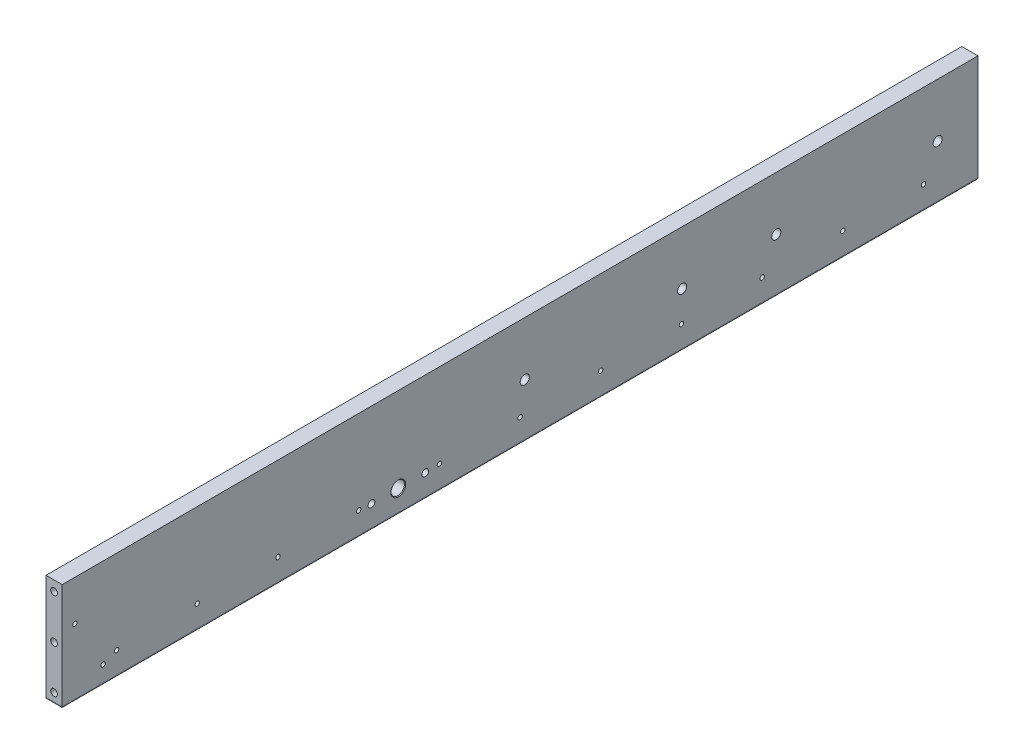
ISO-10303-21;
HEADER;
FILE_DESCRIPTION(('STEP AP214'),'2;1');
FILE_NAME('part.step','',(''),(''),'','','');
FILE_SCHEMA(('AUTOMOTIVE_DESIGN { 1 0 10303 214 1 1 1 1 }'));
ENDSEC;
DATA;
#1=APPLICATION_CONTEXT('core data for automotive mechanical design processes');
#2=APPLICATION_PROTOCOL_DEFINITION('international standard','automotive_design',2000,#1);
#3=PRODUCT_CONTEXT('',#1,'mechanical');
#4=PRODUCT('Part','Part','',(#3));
#5=PRODUCT_RELATED_PRODUCT_CATEGORY('part','',(#4));
#6=PRODUCT_DEFINITION_FORMATION('','',#4);
#7=PRODUCT_DEFINITION_CONTEXT('part definition',#1,'design');
#8=PRODUCT_DEFINITION('design','',#6,#7);
#9=PRODUCT_DEFINITION_SHAPE('','',#8);
#10=(LENGTH_UNIT() NAMED_UNIT(*) SI_UNIT(.MILLI.,.METRE.));
#11=(NAMED_UNIT(*) PLANE_ANGLE_UNIT() SI_UNIT($,.RADIAN.));
#12=(NAMED_UNIT(*) SI_UNIT($,.STERADIAN.) SOLID_ANGLE_UNIT());
#13=UNCERTAINTY_MEASURE_WITH_UNIT(LENGTH_MEASURE(1.E-05),#10,'distance_accuracy_value','');
#14=(GEOMETRIC_REPRESENTATION_CONTEXT(3) GLOBAL_UNCERTAINTY_ASSIGNED_CONTEXT((#13)) GLOBAL_UNIT_ASSIGNED_CONTEXT((#10,
#11,#12)) REPRESENTATION_CONTEXT('',''));
#15=CARTESIAN_POINT('',(0.,0.,0.));
#16=DIRECTION('',(0.,0.,1.));
#17=DIRECTION('',(1.,0.,0.));
#18=AXIS2_PLACEMENT_3D('',#15,#16,#17);
#19=CARTESIAN_POINT('',(-4.50000000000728,-22.5,300.));
#20=DIRECTION('',(1.,0.,0.));
#21=DIRECTION('',(0.,0.,-1.));
#22=AXIS2_PLACEMENT_3D('',#19,#20,#21);
#23=CONICAL_SURFACE('',#22,1.6499999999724,1.04719755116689);
#24=CARTESIAN_POINT('',(-5.45262794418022,-22.5,300.));
#25=VERTEX_POINT('',#24);
#26=VERTEX_LOOP('',#25);
#27=FACE_BOUND('',#26,.T.);
#28=CARTESIAN_POINT('',(-4.49999999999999,-22.5,300.));
#29=DIRECTION('',(1.,0.,0.));
#30=DIRECTION('',(0.,0.,-1.));
#31=AXIS2_PLACEMENT_3D('',#28,#29,#30);
#32=CIRCLE('',#31,1.64999999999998);
#33=CARTESIAN_POINT('',(-4.49999999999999,-22.5,298.35));
#34=VERTEX_POINT('',#33);
#35=EDGE_CURVE('E121',#34,#34,#32,.T.);
#36=ORIENTED_EDGE('',*,*,#35,.T.);
#37=EDGE_LOOP('',(#36));
#38=FACE_BOUND('',#37,.T.);
#39=ADVANCED_FACE('F16',(#27,#38),#23,.F.);
#40=CARTESIAN_POINT('',(-4.50000000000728,-22.5,240.));
#41=DIRECTION('',(1.,0.,0.));
#42=DIRECTION('',(0.,0.,-1.));
#43=AXIS2_PLACEMENT_3D('',#40,#41,#42);
#44=CONICAL_SURFACE('',#43,1.6499999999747,1.04719755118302);
#45=CARTESIAN_POINT('',(-5.45262794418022,-22.5,240.));
#46=VERTEX_POINT('',#45);
#47=VERTEX_LOOP('',#46);
#48=FACE_BOUND('',#47,.T.);
#49=CARTESIAN_POINT('',(-4.49999999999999,-22.5,240.));
#50=DIRECTION('',(1.,0.,0.));
#51=DIRECTION('',(0.,0.,-1.));
#52=AXIS2_PLACEMENT_3D('',#49,#50,#51);
#53=CIRCLE('',#52,1.64999999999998);
#54=CARTESIAN_POINT('',(-4.49999999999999,-22.5,238.35));
#55=VERTEX_POINT('',#54);
#56=EDGE_CURVE('E123',#55,#55,#53,.T.);
#57=ORIENTED_EDGE('',*,*,#56,.T.);
#58=EDGE_LOOP('',(#57));
#59=FACE_BOUND('',#58,.T.);
#60=ADVANCED_FACE('F118',(#48,#59),#44,.F.);
#61=CARTESIAN_POINT('',(-4.50000000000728,-22.5,180.));
#62=DIRECTION('',(1.,0.,0.));
#63=DIRECTION('',(0.,0.,-1.));
#64=AXIS2_PLACEMENT_3D('',#61,#62,#63);
#65=CONICAL_SURFACE('',#64,1.64999999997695,1.04719755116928);
#66=CARTESIAN_POINT('',(-5.45262794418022,-22.5,180.));
#67=VERTEX_POINT('',#66);
#68=VERTEX_LOOP('',#67);
#69=FACE_BOUND('',#68,.T.);
#70=CARTESIAN_POINT('',(-4.49999999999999,-22.5,180.));
#71=DIRECTION('',(1.,0.,0.));
#72=DIRECTION('',(0.,0.,-1.));
#73=AXIS2_PLACEMENT_3D('',#70,#71,#72);
#74=CIRCLE('',#73,1.64999999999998);
#75=CARTESIAN_POINT('',(-4.49999999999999,-22.5,178.35));
#76=VERTEX_POINT('',#75);
#77=EDGE_CURVE('E126',#76,#76,#74,.T.);
#78=ORIENTED_EDGE('',*,*,#77,.T.);
#79=EDGE_LOOP('',(#78));
#80=FACE_BOUND('',#79,.T.);
#81=ADVANCED_FACE('F306',(#69,#80),#65,.F.);
#82=CARTESIAN_POINT('',(-4.49999999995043,-22.5,120.));
#83=DIRECTION('',(1.,0.,0.));
#84=DIRECTION('',(0.,0.,-1.));
#85=AXIS2_PLACEMENT_3D('',#82,#83,#84);
#86=CONICAL_SURFACE('',#85,1.64999999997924,1.04719755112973);
#87=CARTESIAN_POINT('',(-5.45262794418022,-22.5,120.));
#88=VERTEX_POINT('',#87);
#89=VERTEX_LOOP('',#88);
#90=FACE_BOUND('',#89,.T.);
#91=CARTESIAN_POINT('',(-4.49999999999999,-22.5,120.));
#92=DIRECTION('',(1.,0.,0.));
#93=DIRECTION('',(0.,0.,-1.));
#94=AXIS2_PLACEMENT_3D('',#91,#92,#93);
#95=CIRCLE('',#94,1.65);
#96=CARTESIAN_POINT('',(-4.49999999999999,-22.5,118.35));
#97=VERTEX_POINT('',#96);
#98=EDGE_CURVE('E301',#97,#97,#95,.T.);
#99=ORIENTED_EDGE('',*,*,#98,.T.);
#100=EDGE_LOOP('',(#99));
#101=FACE_BOUND('',#100,.T.);
#102=ADVANCED_FACE('F525',(#90,#101),#86,.F.);
#103=CARTESIAN_POINT('',(-4.49999999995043,-22.5,60.0000000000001));
#104=DIRECTION('',(1.,0.,0.));
#105=DIRECTION('',(0.,0.,-1.));
#106=AXIS2_PLACEMENT_3D('',#103,#104,#105);
#107=CONICAL_SURFACE('',#106,1.65000000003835,1.04719755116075);
#108=CARTESIAN_POINT('',(-5.45262794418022,-22.5,60.0000000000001));
#109=VERTEX_POINT('',#108);
#110=VERTEX_LOOP('',#109);
#111=FACE_BOUND('',#110,.T.);
#112=CARTESIAN_POINT('',(-4.49999999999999,-22.5,60.0000000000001));
#113=DIRECTION('',(1.,0.,0.));
#114=DIRECTION('',(0.,0.,-1.));
#115=AXIS2_PLACEMENT_3D('',#112,#113,#114);
#116=CIRCLE('',#115,1.65);
#117=CARTESIAN_POINT('',(-4.49999999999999,-22.5,58.3500000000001));
#118=VERTEX_POINT('',#117);
#119=EDGE_CURVE('E298',#118,#118,#116,.T.);
#120=ORIENTED_EDGE('',*,*,#119,.T.);
#121=EDGE_LOOP('',(#120));
#122=FACE_BOUND('',#121,.T.);
#123=ADVANCED_FACE('F521',(#111,#122),#107,.F.);
#124=CARTESIAN_POINT('',(-4.50000000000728,-22.5,0.));
#125=DIRECTION('',(1.,0.,0.));
#126=DIRECTION('',(0.,0.,-1.));
#127=AXIS2_PLACEMENT_3D('',#124,#125,#126);
#128=CONICAL_SURFACE('',#127,1.64999999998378,1.04719755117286);
#129=CARTESIAN_POINT('',(-5.45262794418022,-22.5,0.));
#130=VERTEX_POINT('',#129);
#131=VERTEX_LOOP('',#130);
#132=FACE_BOUND('',#131,.T.);
#133=CARTESIAN_POINT('',(-4.49999999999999,-22.5,0.));
#134=DIRECTION('',(1.,0.,0.));
#135=DIRECTION('',(0.,0.,-1.));
#136=AXIS2_PLACEMENT_3D('',#133,#134,#135);
#137=CIRCLE('',#136,1.65);
#138=CARTESIAN_POINT('',(-4.49999999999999,-22.5,-1.64999999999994));
#139=VERTEX_POINT('',#138);
#140=EDGE_CURVE('E295',#139,#139,#137,.T.);
#141=ORIENTED_EDGE('',*,*,#140,.T.);
#142=EDGE_LOOP('',(#141));
#143=FACE_BOUND('',#142,.T.);
#144=ADVANCED_FACE('F517',(#132,#143),#128,.F.);
#145=CARTESIAN_POINT('',(-4.49999999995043,-22.5,-59.9999999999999));
#146=DIRECTION('',(1.,0.,0.));
#147=DIRECTION('',(0.,0.,-1.));
#148=AXIS2_PLACEMENT_3D('',#145,#146,#147);
#149=CONICAL_SURFACE('',#148,1.65000000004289,1.04719755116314);
#150=CARTESIAN_POINT('',(-5.45262794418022,-22.5,-59.9999999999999));
#151=VERTEX_POINT('',#150);
#152=VERTEX_LOOP('',#151);
#153=FACE_BOUND('',#152,.T.);
#154=CARTESIAN_POINT('',(-4.49999999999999,-22.5,-59.9999999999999));
#155=DIRECTION('',(1.,0.,0.));
#156=DIRECTION('',(0.,0.,-1.));
#157=AXIS2_PLACEMENT_3D('',#154,#155,#156);
#158=CIRCLE('',#157,1.65);
#159=CARTESIAN_POINT('',(-4.49999999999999,-22.5,-61.6499999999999));
#160=VERTEX_POINT('',#159);
#161=EDGE_CURVE('E292',#160,#160,#158,.T.);
#162=ORIENTED_EDGE('',*,*,#161,.T.);
#163=EDGE_LOOP('',(#162));
#164=FACE_BOUND('',#163,.T.);
#165=ADVANCED_FACE('F513',(#153,#164),#149,.F.);
#166=CARTESIAN_POINT('',(-4.50000000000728,-22.5,-120.));
#167=DIRECTION('',(1.,0.,0.));
#168=DIRECTION('',(0.,0.,-1.));
#169=AXIS2_PLACEMENT_3D('',#166,#167,#168);
#170=CONICAL_SURFACE('',#169,1.64999999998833,1.04719755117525);
#171=CARTESIAN_POINT('',(-5.45262794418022,-22.5,-120.));
#172=VERTEX_POINT('',#171);
#173=VERTEX_LOOP('',#172);
#174=FACE_BOUND('',#173,.T.);
#175=CARTESIAN_POINT('',(-4.49999999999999,-22.5,-120.));
#176=DIRECTION('',(1.,0.,0.));
#177=DIRECTION('',(0.,0.,-1.));
#178=AXIS2_PLACEMENT_3D('',#175,#176,#177);
#179=CIRCLE('',#178,1.65);
#180=CARTESIAN_POINT('',(-4.49999999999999,-22.5,-121.65));
#181=VERTEX_POINT('',#180);
#182=EDGE_CURVE('E289',#181,#181,#179,.T.);
#183=ORIENTED_EDGE('',*,*,#182,.T.);
#184=EDGE_LOOP('',(#183));
#185=FACE_BOUND('',#184,.T.);
#186=ADVANCED_FACE('F509',(#174,#185),#170,.F.);
#187=CARTESIAN_POINT('',(-4.50000000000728,-22.5,-180.));
#188=DIRECTION('',(1.,0.,0.));
#189=DIRECTION('',(0.,0.,-1.));
#190=AXIS2_PLACEMENT_3D('',#187,#188,#189);
#191=CONICAL_SURFACE('',#190,1.6499999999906,1.04719755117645);
#192=CARTESIAN_POINT('',(-5.45262794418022,-22.5,-180.));
#193=VERTEX_POINT('',#192);
#194=VERTEX_LOOP('',#193);
#195=FACE_BOUND('',#194,.T.);
#196=CARTESIAN_POINT('',(-4.49999999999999,-22.5,-180.));
#197=DIRECTION('',(1.,0.,0.));
#198=DIRECTION('',(0.,0.,-1.));
#199=AXIS2_PLACEMENT_3D('',#196,#197,#198);
#200=CIRCLE('',#199,1.64999999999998);
#201=CARTESIAN_POINT('',(-4.49999999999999,-22.5,-181.65));
#202=VERTEX_POINT('',#201);
#203=EDGE_CURVE('E286',#202,#202,#200,.T.);
#204=ORIENTED_EDGE('',*,*,#203,.T.);
#205=EDGE_LOOP('',(#204));
#206=FACE_BOUND('',#205,.T.);
#207=ADVANCED_FACE('F505',(#195,#206),#191,.F.);
#208=CARTESIAN_POINT('',(-4.50000000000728,-22.5,-240.));
#209=DIRECTION('',(1.,0.,0.));
#210=DIRECTION('',(0.,0.,-1.));
#211=AXIS2_PLACEMENT_3D('',#208,#209,#210);
#212=CONICAL_SURFACE('',#211,1.64999999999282,1.04719755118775);
#213=CARTESIAN_POINT('',(-5.45262794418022,-22.5,-240.));
#214=VERTEX_POINT('',#213);
#215=VERTEX_LOOP('',#214);
#216=FACE_BOUND('',#215,.T.);
#217=CARTESIAN_POINT('',(-4.49999999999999,-22.5,-240.));
#218=DIRECTION('',(1.,0.,0.));
#219=DIRECTION('',(0.,0.,-1.));
#220=AXIS2_PLACEMENT_3D('',#217,#218,#219);
#221=CIRCLE('',#220,1.64999999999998);
#222=CARTESIAN_POINT('',(-4.49999999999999,-22.5,-241.65));
#223=VERTEX_POINT('',#222);
#224=EDGE_CURVE('E283',#223,#223,#221,.T.);
#225=ORIENTED_EDGE('',*,*,#224,.T.);
#226=EDGE_LOOP('',(#225));
#227=FACE_BOUND('',#226,.T.);
#228=ADVANCED_FACE('F501',(#216,#227),#212,.F.);
#229=CARTESIAN_POINT('',(-4.50000000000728,-22.5,-300.));
#230=DIRECTION('',(1.,0.,0.));
#231=DIRECTION('',(0.,0.,-1.));
#232=AXIS2_PLACEMENT_3D('',#229,#230,#231);
#233=CONICAL_SURFACE('',#232,1.650000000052,1.04719755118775);
#234=CARTESIAN_POINT('',(-5.45262794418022,-22.5,-300.));
#235=VERTEX_POINT('',#234);
#236=VERTEX_LOOP('',#235);
#237=FACE_BOUND('',#236,.T.);
#238=CARTESIAN_POINT('',(-4.49999999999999,-22.5,-300.));
#239=DIRECTION('',(1.,0.,0.));
#240=DIRECTION('',(0.,0.,-1.));
#241=AXIS2_PLACEMENT_3D('',#238,#239,#240);
#242=CIRCLE('',#241,1.64999999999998);
#243=CARTESIAN_POINT('',(-4.49999999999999,-22.5,-301.65));
#244=VERTEX_POINT('',#243);
#245=EDGE_CURVE('E280',#244,#244,#242,.T.);
#246=ORIENTED_EDGE('',*,*,#245,.T.);
#247=EDGE_LOOP('',(#246));
#248=FACE_BOUND('',#247,.T.);
#249=ADVANCED_FACE('F497',(#237,#248),#233,.F.);
#250=CARTESIAN_POINT('',(0.,-32.5,323.500000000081));
#251=DIRECTION('',(0.,0.,1.));
#252=DIRECTION('',(1.,0.,0.));
#253=AXIS2_PLACEMENT_3D('',#250,#251,#252);
#254=CONICAL_SURFACE('',#253,2.49999999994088,1.02974425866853);
#255=CARTESIAN_POINT('',(-5.6843418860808E-11,-32.5,321.997848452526));
#256=VERTEX_POINT('',#255);
#257=VERTEX_LOOP('',#256);
#258=FACE_BOUND('',#257,.T.);
#259=CARTESIAN_POINT('',(0.,-32.5,323.5));
#260=DIRECTION('',(0.,0.,1.));
#261=DIRECTION('',(1.,0.,0.));
#262=AXIS2_PLACEMENT_3D('',#259,#260,#261);
#263=CIRCLE('',#262,2.49999999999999);
#264=CARTESIAN_POINT('',(2.49999999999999,-32.5,323.5));
#265=VERTEX_POINT('',#264);
#266=EDGE_CURVE('E274',#265,#265,#263,.T.);
#267=ORIENTED_EDGE('',*,*,#266,.T.);
#268=EDGE_LOOP('',(#267));
#269=FACE_BOUND('',#268,.T.);
#270=ADVANCED_FACE('F493',(#258,#269),#254,.F.);
#271=CARTESIAN_POINT('',(0.,0.,323.500000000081));
#272=DIRECTION('',(0.,0.,1.));
#273=DIRECTION('',(1.,0.,0.));
#274=AXIS2_PLACEMENT_3D('',#271,#272,#273);
#275=CONICAL_SURFACE('',#274,2.49999999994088,1.02974425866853);
#276=CARTESIAN_POINT('',(-5.6843418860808E-11,0.,321.997848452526));
#277=VERTEX_POINT('',#276);
#278=VERTEX_LOOP('',#277);
#279=FACE_BOUND('',#278,.T.);
#280=CARTESIAN_POINT('',(0.,0.,323.5));
#281=DIRECTION('',(0.,0.,1.));
#282=DIRECTION('',(1.,0.,0.));
#283=AXIS2_PLACEMENT_3D('',#280,#281,#282);
#284=CIRCLE('',#283,2.49999999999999);
#285=CARTESIAN_POINT('',(2.49999999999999,0.,323.5));
#286=VERTEX_POINT('',#285);
#287=EDGE_CURVE('E271',#286,#286,#284,.T.);
#288=ORIENTED_EDGE('',*,*,#287,.T.);
#289=EDGE_LOOP('',(#288));
#290=FACE_BOUND('',#289,.T.);
#291=ADVANCED_FACE('F489',(#279,#290),#275,.F.);
#292=CARTESIAN_POINT('',(0.,32.5,323.500000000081));
#293=DIRECTION('',(0.,0.,1.));
#294=DIRECTION('',(1.,0.,0.));
#295=AXIS2_PLACEMENT_3D('',#292,#293,#294);
#296=CONICAL_SURFACE('',#295,2.49999999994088,1.02974425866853);
#297=CARTESIAN_POINT('',(-5.6843418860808E-11,32.5,321.997848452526));
#298=VERTEX_POINT('',#297);
#299=VERTEX_LOOP('',#298);
#300=FACE_BOUND('',#299,.T.);
#301=CARTESIAN_POINT('',(0.,32.5,323.5));
#302=DIRECTION('',(0.,0.,1.));
#303=DIRECTION('',(1.,0.,0.));
#304=AXIS2_PLACEMENT_3D('',#301,#302,#303);
#305=CIRCLE('',#304,2.49999999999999);
#306=CARTESIAN_POINT('',(2.49999999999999,32.5,323.5));
#307=VERTEX_POINT('',#306);
#308=EDGE_CURVE('E268',#307,#307,#305,.T.);
#309=ORIENTED_EDGE('',*,*,#308,.T.);
#310=EDGE_LOOP('',(#309));
#311=FACE_BOUND('',#310,.T.);
#312=ADVANCED_FACE('F485',(#300,#311),#296,.F.);
#313=CARTESIAN_POINT('',(0.,-32.5,-323.500000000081));
#314=DIRECTION('',(0.,0.,-1.));
#315=DIRECTION('',(-1.,0.,0.));
#316=AXIS2_PLACEMENT_3D('',#313,#314,#315);
#317=CONICAL_SURFACE('',#316,2.49999999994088,1.02974425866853);
#318=CARTESIAN_POINT('',(-5.6843418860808E-11,-32.5,-321.997848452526));
#319=VERTEX_POINT('',#318);
#320=VERTEX_LOOP('',#319);
#321=FACE_BOUND('',#320,.T.);
#322=CARTESIAN_POINT('',(0.,-32.5,-323.5));
#323=DIRECTION('',(0.,0.,-1.));
#324=DIRECTION('',(-1.,0.,0.));
#325=AXIS2_PLACEMENT_3D('',#322,#323,#324);
#326=CIRCLE('',#325,2.49999999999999);
#327=CARTESIAN_POINT('',(-2.49999999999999,-32.5,-323.5));
#328=VERTEX_POINT('',#327);
#329=EDGE_CURVE('E260',#328,#328,#326,.T.);
#330=ORIENTED_EDGE('',*,*,#329,.T.);
#331=EDGE_LOOP('',(#330));
#332=FACE_BOUND('',#331,.T.);
#333=ADVANCED_FACE('F481',(#321,#332),#317,.F.);
#334=CARTESIAN_POINT('',(0.,0.,-323.500000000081));
#335=DIRECTION('',(0.,0.,-1.));
#336=DIRECTION('',(-1.,0.,0.));
#337=AXIS2_PLACEMENT_3D('',#334,#335,#336);
#338=CONICAL_SURFACE('',#337,2.49999999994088,1.02974425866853);
#339=CARTESIAN_POINT('',(-5.6843418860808E-11,0.,-321.997848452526));
#340=VERTEX_POINT('',#339);
#341=VERTEX_LOOP('',#340);
#342=FACE_BOUND('',#341,.T.);
#343=CARTESIAN_POINT('',(0.,0.,-323.5));
#344=DIRECTION('',(0.,0.,-1.));
#345=DIRECTION('',(-1.,0.,0.));
#346=AXIS2_PLACEMENT_3D('',#343,#344,#345);
#347=CIRCLE('',#346,2.49999999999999);
#348=CARTESIAN_POINT('',(-2.49999999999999,0.,-323.5));
#349=VERTEX_POINT('',#348);
#350=EDGE_CURVE('E255',#349,#349,#347,.T.);
#351=ORIENTED_EDGE('',*,*,#350,.T.);
#352=EDGE_LOOP('',(#351));
#353=FACE_BOUND('',#352,.T.);
#354=ADVANCED_FACE('F478',(#342,#353),#338,.F.);
#355=CARTESIAN_POINT('',(0.,32.5,-323.500000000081));
#356=DIRECTION('',(0.,0.,-1.));
#357=DIRECTION('',(-1.,0.,0.));
#358=AXIS2_PLACEMENT_3D('',#355,#356,#357);
#359=CONICAL_SURFACE('',#358,2.49999999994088,1.02974425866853);
#360=CARTESIAN_POINT('',(-5.6843418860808E-11,32.5,-321.997848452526));
#361=VERTEX_POINT('',#360);
#362=VERTEX_LOOP('',#361);
#363=FACE_BOUND('',#362,.T.);
#364=CARTESIAN_POINT('',(0.,32.5,-323.5));
#365=DIRECTION('',(0.,0.,-1.));
#366=DIRECTION('',(-1.,0.,0.));
#367=AXIS2_PLACEMENT_3D('',#364,#365,#366);
#368=CIRCLE('',#367,2.49999999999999);
#369=CARTESIAN_POINT('',(-2.49999999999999,32.5,-323.5));
#370=VERTEX_POINT('',#369);
#371=EDGE_CURVE('E250',#370,#370,#368,.T.);
#372=ORIENTED_EDGE('',*,*,#371,.T.);
#373=EDGE_LOOP('',(#372));
#374=FACE_BOUND('',#373,.T.);
#375=ADVANCED_FACE('F475',(#363,#374),#359,.F.);
#376=CARTESIAN_POINT('',(6.00000000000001,-22.5,300.));
#377=DIRECTION('',(1.,0.,0.));
#378=DIRECTION('',(0.,0.,-1.));
#379=AXIS2_PLACEMENT_3D('',#376,#377,#378);
#380=CYLINDRICAL_SURFACE('',#379,1.64999999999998);
#381=ORIENTED_EDGE('',*,*,#35,.F.);
#382=EDGE_LOOP('',(#381));
#383=FACE_BOUND('',#382,.T.);
#384=CARTESIAN_POINT('',(6.00000000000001,-22.5,300.));
#385=DIRECTION('',(1.,0.,0.));
#386=DIRECTION('',(0.,0.,-1.));
#387=AXIS2_PLACEMENT_3D('',#384,#385,#386);
#388=CIRCLE('',#387,1.64999999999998);
#389=CARTESIAN_POINT('',(6.00000000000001,-22.5,298.35));
#390=VERTEX_POINT('',#389);
#391=EDGE_CURVE('E246',#390,#390,#388,.T.);
#392=ORIENTED_EDGE('',*,*,#391,.T.);
#393=EDGE_LOOP('',(#392));
#394=FACE_BOUND('',#393,.T.);
#395=ADVANCED_FACE('F471',(#383,#394),#380,.F.);
#396=CARTESIAN_POINT('',(6.00000000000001,-22.5,240.));
#397=DIRECTION('',(1.,0.,0.));
#398=DIRECTION('',(0.,0.,-1.));
#399=AXIS2_PLACEMENT_3D('',#396,#397,#398);
#400=CYLINDRICAL_SURFACE('',#399,1.64999999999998);
#401=ORIENTED_EDGE('',*,*,#56,.F.);
#402=EDGE_LOOP('',(#401));
#403=FACE_BOUND('',#402,.T.);
#404=CARTESIAN_POINT('',(6.00000000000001,-22.5,240.));
#405=DIRECTION('',(1.,0.,0.));
#406=DIRECTION('',(0.,0.,-1.));
#407=AXIS2_PLACEMENT_3D('',#404,#405,#406);
#408=CIRCLE('',#407,1.64999999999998);
#409=CARTESIAN_POINT('',(6.00000000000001,-22.5,238.35));
#410=VERTEX_POINT('',#409);
#411=EDGE_CURVE('E243',#410,#410,#408,.T.);
#412=ORIENTED_EDGE('',*,*,#411,.T.);
#413=EDGE_LOOP('',(#412));
#414=FACE_BOUND('',#413,.T.);
#415=ADVANCED_FACE('F312',(#403,#414),#400,.F.);
#416=CARTESIAN_POINT('',(6.00000000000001,-22.5,180.));
#417=DIRECTION('',(1.,0.,0.));
#418=DIRECTION('',(0.,0.,-1.));
#419=AXIS2_PLACEMENT_3D('',#416,#417,#418);
#420=CYLINDRICAL_SURFACE('',#419,1.64999999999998);
#421=ORIENTED_EDGE('',*,*,#77,.F.);
#422=EDGE_LOOP('',(#421));
#423=FACE_BOUND('',#422,.T.);
#424=CARTESIAN_POINT('',(6.00000000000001,-22.5,180.));
#425=DIRECTION('',(1.,0.,0.));
#426=DIRECTION('',(0.,0.,-1.));
#427=AXIS2_PLACEMENT_3D('',#424,#425,#426);
#428=CIRCLE('',#427,1.64999999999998);
#429=CARTESIAN_POINT('',(6.00000000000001,-22.5,178.35));
#430=VERTEX_POINT('',#429);
#431=EDGE_CURVE('E240',#430,#430,#428,.T.);
#432=ORIENTED_EDGE('',*,*,#431,.T.);
#433=EDGE_LOOP('',(#432));
#434=FACE_BOUND('',#433,.T.);
#435=ADVANCED_FACE('F308',(#423,#434),#420,.F.);
#436=CARTESIAN_POINT('',(6.00000000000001,-22.5,120.));
#437=DIRECTION('',(1.,0.,0.));
#438=DIRECTION('',(0.,0.,-1.));
#439=AXIS2_PLACEMENT_3D('',#436,#437,#438);
#440=CYLINDRICAL_SURFACE('',#439,1.65);
#441=ORIENTED_EDGE('',*,*,#98,.F.);
#442=EDGE_LOOP('',(#441));
#443=FACE_BOUND('',#442,.T.);
#444=CARTESIAN_POINT('',(6.00000000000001,-22.5,120.));
#445=DIRECTION('',(1.,0.,0.));
#446=DIRECTION('',(0.,0.,-1.));
#447=AXIS2_PLACEMENT_3D('',#444,#445,#446);
#448=CIRCLE('',#447,1.65);
#449=CARTESIAN_POINT('',(6.00000000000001,-22.5,118.35));
#450=VERTEX_POINT('',#449);
#451=EDGE_CURVE('E237',#450,#450,#448,.T.);
#452=ORIENTED_EDGE('',*,*,#451,.T.);
#453=EDGE_LOOP('',(#452));
#454=FACE_BOUND('',#453,.T.);
#455=ADVANCED_FACE('F311',(#443,#454),#440,.F.);
#456=CARTESIAN_POINT('',(6.00000000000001,-22.5,60.0000000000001));
#457=DIRECTION('',(1.,0.,0.));
#458=DIRECTION('',(0.,0.,-1.));
#459=AXIS2_PLACEMENT_3D('',#456,#457,#458);
#460=CYLINDRICAL_SURFACE('',#459,1.65);
#461=ORIENTED_EDGE('',*,*,#119,.F.);
#462=EDGE_LOOP('',(#461));
#463=FACE_BOUND('',#462,.T.);
#464=CARTESIAN_POINT('',(6.00000000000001,-22.5,60.0000000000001));
#465=DIRECTION('',(1.,0.,0.));
#466=DIRECTION('',(0.,0.,-1.));
#467=AXIS2_PLACEMENT_3D('',#464,#465,#466);
#468=CIRCLE('',#467,1.65);
#469=CARTESIAN_POINT('',(6.00000000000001,-22.5,58.3500000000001));
#470=VERTEX_POINT('',#469);
#471=EDGE_CURVE('E234',#470,#470,#468,.T.);
#472=ORIENTED_EDGE('',*,*,#471,.T.);
#473=EDGE_LOOP('',(#472));
#474=FACE_BOUND('',#473,.T.);
#475=ADVANCED_FACE('F461',(#463,#474),#460,.F.);
#476=CARTESIAN_POINT('',(6.00000000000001,-22.5,0.));
#477=DIRECTION('',(1.,0.,0.));
#478=DIRECTION('',(0.,0.,-1.));
#479=AXIS2_PLACEMENT_3D('',#476,#477,#478);
#480=CYLINDRICAL_SURFACE('',#479,1.65);
#481=ORIENTED_EDGE('',*,*,#140,.F.);
#482=EDGE_LOOP('',(#481));
#483=FACE_BOUND('',#482,.T.);
#484=CARTESIAN_POINT('',(6.00000000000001,-22.5,0.));
#485=DIRECTION('',(1.,0.,0.));
#486=DIRECTION('',(0.,0.,-1.));
#487=AXIS2_PLACEMENT_3D('',#484,#485,#486);
#488=CIRCLE('',#487,1.65);
#489=CARTESIAN_POINT('',(6.00000000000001,-22.5,-1.64999999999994));
#490=VERTEX_POINT('',#489);
#491=EDGE_CURVE('E231',#490,#490,#488,.T.);
#492=ORIENTED_EDGE('',*,*,#491,.T.);
#493=EDGE_LOOP('',(#492));
#494=FACE_BOUND('',#493,.T.);
#495=ADVANCED_FACE('F457',(#483,#494),#480,.F.);
#496=CARTESIAN_POINT('',(6.00000000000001,-22.5,-59.9999999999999));
#497=DIRECTION('',(1.,0.,0.));
#498=DIRECTION('',(0.,0.,-1.));
#499=AXIS2_PLACEMENT_3D('',#496,#497,#498);
#500=CYLINDRICAL_SURFACE('',#499,1.65);
#501=ORIENTED_EDGE('',*,*,#161,.F.);
#502=EDGE_LOOP('',(#501));
#503=FACE_BOUND('',#502,.T.);
#504=CARTESIAN_POINT('',(6.00000000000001,-22.5,-59.9999999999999));
#505=DIRECTION('',(1.,0.,0.));
#506=DIRECTION('',(0.,0.,-1.));
#507=AXIS2_PLACEMENT_3D('',#504,#505,#506);
#508=CIRCLE('',#507,1.65);
#509=CARTESIAN_POINT('',(6.00000000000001,-22.5,-61.6499999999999));
#510=VERTEX_POINT('',#509);
#511=EDGE_CURVE('E228',#510,#510,#508,.T.);
#512=ORIENTED_EDGE('',*,*,#511,.T.);
#513=EDGE_LOOP('',(#512));
#514=FACE_BOUND('',#513,.T.);
#515=ADVANCED_FACE('F453',(#503,#514),#500,.F.);
#516=CARTESIAN_POINT('',(6.00000000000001,-22.5,-120.));
#517=DIRECTION('',(1.,0.,0.));
#518=DIRECTION('',(0.,0.,-1.));
#519=AXIS2_PLACEMENT_3D('',#516,#517,#518);
#520=CYLINDRICAL_SURFACE('',#519,1.65);
#521=ORIENTED_EDGE('',*,*,#182,.F.);
#522=EDGE_LOOP('',(#521));
#523=FACE_BOUND('',#522,.T.);
#524=CARTESIAN_POINT('',(6.00000000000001,-22.5,-120.));
#525=DIRECTION('',(1.,0.,0.));
#526=DIRECTION('',(0.,0.,-1.));
#527=AXIS2_PLACEMENT_3D('',#524,#525,#526);
#528=CIRCLE('',#527,1.65);
#529=CARTESIAN_POINT('',(6.00000000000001,-22.5,-121.65));
#530=VERTEX_POINT('',#529);
#531=EDGE_CURVE('E225',#530,#530,#528,.T.);
#532=ORIENTED_EDGE('',*,*,#531,.T.);
#533=EDGE_LOOP('',(#532));
#534=FACE_BOUND('',#533,.T.);
#535=ADVANCED_FACE('F449',(#523,#534),#520,.F.);
#536=CARTESIAN_POINT('',(6.00000000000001,-22.5,-180.));
#537=DIRECTION('',(1.,0.,0.));
#538=DIRECTION('',(0.,0.,-1.));
#539=AXIS2_PLACEMENT_3D('',#536,#537,#538);
#540=CYLINDRICAL_SURFACE('',#539,1.64999999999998);
#541=ORIENTED_EDGE('',*,*,#203,.F.);
#542=EDGE_LOOP('',(#541));
#543=FACE_BOUND('',#542,.T.);
#544=CARTESIAN_POINT('',(6.00000000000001,-22.5,-180.));
#545=DIRECTION('',(1.,0.,0.));
#546=DIRECTION('',(0.,0.,-1.));
#547=AXIS2_PLACEMENT_3D('',#544,#545,#546);
#548=CIRCLE('',#547,1.64999999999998);
#549=CARTESIAN_POINT('',(6.00000000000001,-22.5,-181.65));
#550=VERTEX_POINT('',#549);
#551=EDGE_CURVE('E222',#550,#550,#548,.T.);
#552=ORIENTED_EDGE('',*,*,#551,.T.);
#553=EDGE_LOOP('',(#552));
#554=FACE_BOUND('',#553,.T.);
#555=ADVANCED_FACE('F445',(#543,#554),#540,.F.);
#556=CARTESIAN_POINT('',(6.00000000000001,-22.5,-240.));
#557=DIRECTION('',(1.,0.,0.));
#558=DIRECTION('',(0.,0.,-1.));
#559=AXIS2_PLACEMENT_3D('',#556,#557,#558);
#560=CYLINDRICAL_SURFACE('',#559,1.64999999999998);
#561=ORIENTED_EDGE('',*,*,#224,.F.);
#562=EDGE_LOOP('',(#561));
#563=FACE_BOUND('',#562,.T.);
#564=CARTESIAN_POINT('',(6.00000000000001,-22.5,-240.));
#565=DIRECTION('',(1.,0.,0.));
#566=DIRECTION('',(0.,0.,-1.));
#567=AXIS2_PLACEMENT_3D('',#564,#565,#566);
#568=CIRCLE('',#567,1.64999999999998);
#569=CARTESIAN_POINT('',(6.00000000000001,-22.5,-241.65));
#570=VERTEX_POINT('',#569);
#571=EDGE_CURVE('E219',#570,#570,#568,.T.);
#572=ORIENTED_EDGE('',*,*,#571,.T.);
#573=EDGE_LOOP('',(#572));
#574=FACE_BOUND('',#573,.T.);
#575=ADVANCED_FACE('F441',(#563,#574),#560,.F.);
#576=CARTESIAN_POINT('',(6.00000000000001,-22.5,-300.));
#577=DIRECTION('',(1.,0.,0.));
#578=DIRECTION('',(0.,0.,-1.));
#579=AXIS2_PLACEMENT_3D('',#576,#577,#578);
#580=CYLINDRICAL_SURFACE('',#579,1.64999999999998);
#581=ORIENTED_EDGE('',*,*,#245,.F.);
#582=EDGE_LOOP('',(#581));
#583=FACE_BOUND('',#582,.T.);
#584=CARTESIAN_POINT('',(6.00000000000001,-22.5,-300.));
#585=DIRECTION('',(1.,0.,0.));
#586=DIRECTION('',(0.,0.,-1.));
#587=AXIS2_PLACEMENT_3D('',#584,#585,#586);
#588=CIRCLE('',#587,1.64999999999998);
#589=CARTESIAN_POINT('',(6.00000000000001,-22.5,-301.65));
#590=VERTEX_POINT('',#589);
#591=EDGE_CURVE('E216',#590,#590,#588,.T.);
#592=ORIENTED_EDGE('',*,*,#591,.T.);
#593=EDGE_LOOP('',(#592));
#594=FACE_BOUND('',#593,.T.);
#595=ADVANCED_FACE('F437',(#583,#594),#580,.F.);
#596=CARTESIAN_POINT('',(5.99999999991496,-23.,90.5));
#597=DIRECTION('',(1.,0.,0.));
#598=DIRECTION('',(0.,1.,0.));
#599=AXIS2_PLACEMENT_3D('',#596,#597,#598);
#600=CONICAL_SURFACE('',#599,5.49999999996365,0.785398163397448);
#601=CARTESIAN_POINT('',(5.99999999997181,-23.,90.5));
#602=DIRECTION('',(1.,0.,0.));
#603=DIRECTION('',(0.,1.,0.));
#604=AXIS2_PLACEMENT_3D('',#601,#602,#603);
#605=CIRCLE('',#604,5.50000000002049);
#606=CARTESIAN_POINT('',(5.9999999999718,-17.4999999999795,90.5));
#607=VERTEX_POINT('',#606);
#608=EDGE_CURVE('E213',#607,#607,#605,.T.);
#609=ORIENTED_EDGE('',*,*,#608,.T.);
#610=EDGE_LOOP('',(#609));
#611=FACE_BOUND('',#610,.T.);
#612=CARTESIAN_POINT('',(5.50000000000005,-23.,90.5));
#613=DIRECTION('',(-1.,0.,0.));
#614=DIRECTION('',(0.,-1.,0.));
#615=AXIS2_PLACEMENT_3D('',#612,#613,#614);
#616=CIRCLE('',#615,5.);
#617=CARTESIAN_POINT('',(5.50000000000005,-28.,90.5));
#618=VERTEX_POINT('',#617);
#619=EDGE_CURVE('E277',#618,#618,#616,.T.);
#620=ORIENTED_EDGE('',*,*,#619,.T.);
#621=EDGE_LOOP('',(#620));
#622=FACE_BOUND('',#621,.T.);
#623=ADVANCED_FACE('F434',(#611,#622),#600,.F.);
#624=CARTESIAN_POINT('',(4.50000000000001,-38.5,340.5));
#625=DIRECTION('',(0.,0.,-1.));
#626=DIRECTION('',(-1.,0.,0.));
#627=AXIS2_PLACEMENT_3D('',#624,#625,#626);
#628=CYLINDRICAL_SURFACE('',#627,1.5);
#629=CARTESIAN_POINT('',(4.50000000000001,-38.5,-339.));
#630=DIRECTION('',(0.707106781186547,0.,0.707106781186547));
#631=DIRECTION('',(0.707106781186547,0.,-0.707106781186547));
#632=AXIS2_PLACEMENT_3D('',#629,#630,#631);
#633=ELLIPSE('',#632,2.12132034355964,1.5);
#634=CARTESIAN_POINT('',(6.00000000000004,-38.5,-340.5));
#635=VERTEX_POINT('',#634);
#636=CARTESIAN_POINT('',(4.50000000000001,-40.,-339.));
#637=VERTEX_POINT('',#636);
#638=EDGE_CURVE('E249',#635,#637,#633,.F.);
#639=ORIENTED_EDGE('',*,*,#638,.F.);
#640=DIRECTION('',(0.,0.,1.));
#641=VECTOR('',#640,1.);
#642=CARTESIAN_POINT('',(6.00000000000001,-38.5,340.5));
#643=LINE('',#642,#641);
#644=CARTESIAN_POINT('',(6.00000000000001,-38.5,340.5));
#645=VERTEX_POINT('',#644);
#646=EDGE_CURVE('E212',#635,#645,#643,.T.);
#647=ORIENTED_EDGE('',*,*,#646,.T.);
#648=CARTESIAN_POINT('',(4.50000000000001,-38.5,339.));
#649=DIRECTION('',(-0.707106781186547,0.,0.707106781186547));
#650=DIRECTION('',(-0.707106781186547,0.,-0.707106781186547));
#651=AXIS2_PLACEMENT_3D('',#648,#649,#650);
#652=ELLIPSE('',#651,2.12132034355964,1.5);
#653=CARTESIAN_POINT('',(4.50000000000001,-40.,339.));
#654=VERTEX_POINT('',#653);
#655=EDGE_CURVE('E19',#654,#645,#652,.T.);
#656=ORIENTED_EDGE('',*,*,#655,.F.);
#657=DIRECTION('',(0.,0.,1.));
#658=VECTOR('',#657,1.);
#659=CARTESIAN_POINT('',(4.50000000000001,-40.,340.5));
#660=LINE('',#659,#658);
#661=EDGE_CURVE('E263',#654,#637,#660,.F.);
#662=ORIENTED_EDGE('',*,*,#661,.T.);
#663=EDGE_LOOP('',(#639,#647,#656,#662));
#664=FACE_BOUND('',#663,.T.);
#665=ADVANCED_FACE('F430',(#664),#628,.T.);
#666=CARTESIAN_POINT('',(6.00000000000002,-23.,90.5));
#667=DIRECTION('',(-1.,0.,0.));
#668=DIRECTION('',(0.,-1.,0.));
#669=AXIS2_PLACEMENT_3D('',#666,#667,#668);
#670=CYLINDRICAL_SURFACE('',#669,5.);
#671=CARTESIAN_POINT('',(-5.49999999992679,-23.,90.5));
#672=DIRECTION('',(-1.,0.,0.));
#673=DIRECTION('',(0.,0.,1.));
#674=AXIS2_PLACEMENT_3D('',#671,#672,#673);
#675=CIRCLE('',#674,5.00000000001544);
#676=CARTESIAN_POINT('',(-5.49999999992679,-23.,95.5000000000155));
#677=VERTEX_POINT('',#676);
#678=EDGE_CURVE('E199',#677,#677,#675,.T.);
#679=ORIENTED_EDGE('',*,*,#678,.T.);
#680=EDGE_LOOP('',(#679));
#681=FACE_BOUND('',#680,.T.);
#682=ORIENTED_EDGE('',*,*,#619,.F.);
#683=EDGE_LOOP('',(#682));
#684=FACE_BOUND('',#683,.T.);
#685=ADVANCED_FACE('F426',(#681,#684),#670,.F.);
#686=CARTESIAN_POINT('',(0.,-32.5,340.5));
#687=DIRECTION('',(0.,0.,1.));
#688=DIRECTION('',(1.,0.,0.));
#689=AXIS2_PLACEMENT_3D('',#686,#687,#688);
#690=CYLINDRICAL_SURFACE('',#689,2.49999999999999);
#691=CARTESIAN_POINT('',(0.,-32.5,340.5));
#692=DIRECTION('',(0.,0.,1.));
#693=DIRECTION('',(1.,0.,0.));
#694=AXIS2_PLACEMENT_3D('',#691,#692,#693);
#695=CIRCLE('',#694,2.49999999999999);
#696=CARTESIAN_POINT('',(2.49999999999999,-32.5,340.5));
#697=VERTEX_POINT('',#696);
#698=EDGE_CURVE('E183',#697,#697,#695,.F.);
#699=ORIENTED_EDGE('',*,*,#698,.F.);
#700=EDGE_LOOP('',(#699));
#701=FACE_BOUND('',#700,.T.);
#702=ORIENTED_EDGE('',*,*,#266,.F.);
#703=EDGE_LOOP('',(#702));
#704=FACE_BOUND('',#703,.T.);
#705=ADVANCED_FACE('F422',(#701,#704),#690,.F.);
#706=CARTESIAN_POINT('',(0.,0.,340.5));
#707=DIRECTION('',(0.,0.,1.));
#708=DIRECTION('',(1.,0.,0.));
#709=AXIS2_PLACEMENT_3D('',#706,#707,#708);
#710=CYLINDRICAL_SURFACE('',#709,2.49999999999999);
#711=CARTESIAN_POINT('',(0.,0.,340.5));
#712=DIRECTION('',(0.,0.,1.));
#713=DIRECTION('',(1.,0.,0.));
#714=AXIS2_PLACEMENT_3D('',#711,#712,#713);
#715=CIRCLE('',#714,2.49999999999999);
#716=CARTESIAN_POINT('',(2.49999999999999,0.,340.5));
#717=VERTEX_POINT('',#716);
#718=EDGE_CURVE('E180',#717,#717,#715,.F.);
#719=ORIENTED_EDGE('',*,*,#718,.F.);
#720=EDGE_LOOP('',(#719));
#721=FACE_BOUND('',#720,.T.);
#722=ORIENTED_EDGE('',*,*,#287,.F.);
#723=EDGE_LOOP('',(#722));
#724=FACE_BOUND('',#723,.T.);
#725=ADVANCED_FACE('F418',(#721,#724),#710,.F.);
#726=CARTESIAN_POINT('',(0.,32.5,340.5));
#727=DIRECTION('',(0.,0.,1.));
#728=DIRECTION('',(1.,0.,0.));
#729=AXIS2_PLACEMENT_3D('',#726,#727,#728);
#730=CYLINDRICAL_SURFACE('',#729,2.49999999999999);
#731=CARTESIAN_POINT('',(0.,32.5,340.5));
#732=DIRECTION('',(0.,0.,1.));
#733=DIRECTION('',(1.,0.,0.));
#734=AXIS2_PLACEMENT_3D('',#731,#732,#733);
#735=CIRCLE('',#734,2.49999999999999);
#736=CARTESIAN_POINT('',(2.49999999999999,32.5,340.5));
#737=VERTEX_POINT('',#736);
#738=EDGE_CURVE('E176',#737,#737,#735,.F.);
#739=ORIENTED_EDGE('',*,*,#738,.F.);
#740=EDGE_LOOP('',(#739));
#741=FACE_BOUND('',#740,.T.);
#742=ORIENTED_EDGE('',*,*,#308,.F.);
#743=EDGE_LOOP('',(#742));
#744=FACE_BOUND('',#743,.T.);
#745=ADVANCED_FACE('F414',(#741,#744),#730,.F.);
#746=CARTESIAN_POINT('',(-5.99999999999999,-38.5,339.));
#747=DIRECTION('',(-1.,0.,0.));
#748=DIRECTION('',(0.,0.,1.));
#749=AXIS2_PLACEMENT_3D('',#746,#747,#748);
#750=CYLINDRICAL_SURFACE('',#749,1.5);
#751=CARTESIAN_POINT('',(-4.49999999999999,-38.5,339.));
#752=DIRECTION('',(-0.707106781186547,0.,-0.707106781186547));
#753=DIRECTION('',(0.707106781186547,0.,-0.707106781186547));
#754=AXIS2_PLACEMENT_3D('',#751,#752,#753);
#755=ELLIPSE('',#754,2.12132034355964,1.5);
#756=CARTESIAN_POINT('',(-4.49999999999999,-40.,339.));
#757=VERTEX_POINT('',#756);
#758=CARTESIAN_POINT('',(-5.99999999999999,-38.5,340.5));
#759=VERTEX_POINT('',#758);
#760=EDGE_CURVE('E173',#757,#759,#755,.T.);
#761=ORIENTED_EDGE('',*,*,#760,.F.);
#762=DIRECTION('',(1.,0.,0.));
#763=VECTOR('',#762,1.);
#764=CARTESIAN_POINT('',(-5.99999999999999,-40.,339.));
#765=LINE('',#764,#763);
#766=EDGE_CURVE('E1066',#757,#654,#765,.T.);
#767=ORIENTED_EDGE('',*,*,#766,.T.);
#768=ORIENTED_EDGE('',*,*,#655,.T.);
#769=DIRECTION('',(1.,0.,0.));
#770=VECTOR('',#769,1.);
#771=CARTESIAN_POINT('',(-5.99999999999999,-38.5,340.5));
#772=LINE('',#771,#770);
#773=EDGE_CURVE('E179',#759,#645,#772,.T.);
#774=ORIENTED_EDGE('',*,*,#773,.F.);
#775=EDGE_LOOP('',(#761,#767,#768,#774));
#776=FACE_BOUND('',#775,.T.);
#777=ADVANCED_FACE('F410',(#776),#750,.T.);
#778=CARTESIAN_POINT('',(-5.99999999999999,-40.,340.5));
#779=DIRECTION('',(0.,1.,0.));
#780=DIRECTION('',(0.,0.,1.));
#781=AXIS2_PLACEMENT_3D('',#778,#779,#780);
#782=PLANE('',#781);
#783=ORIENTED_EDGE('',*,*,#661,.F.);
#784=ORIENTED_EDGE('',*,*,#766,.F.);
#785=DIRECTION('',(0.,0.,-1.));
#786=VECTOR('',#785,1.);
#787=CARTESIAN_POINT('',(-4.49999999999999,-40.,340.5));
#788=LINE('',#787,#786);
#789=CARTESIAN_POINT('',(-4.49999999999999,-40.,-339.));
#790=VERTEX_POINT('',#789);
#791=EDGE_CURVE('E169',#790,#757,#788,.F.);
#792=ORIENTED_EDGE('',*,*,#791,.F.);
#793=DIRECTION('',(1.,0.,0.));
#794=VECTOR('',#793,1.);
#795=CARTESIAN_POINT('',(-5.99999999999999,-40.,-339.));
#796=LINE('',#795,#794);
#797=EDGE_CURVE('E248',#637,#790,#796,.F.);
#798=ORIENTED_EDGE('',*,*,#797,.F.);
#799=EDGE_LOOP('',(#783,#784,#792,#798));
#800=FACE_BOUND('',#799,.T.);
#801=ADVANCED_FACE('F406',(#800),#782,.F.);
#802=CARTESIAN_POINT('',(0.,-32.5,-340.5));
#803=DIRECTION('',(0.,0.,-1.));
#804=DIRECTION('',(-1.,0.,0.));
#805=AXIS2_PLACEMENT_3D('',#802,#803,#804);
#806=CYLINDRICAL_SURFACE('',#805,2.49999999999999);
#807=ORIENTED_EDGE('',*,*,#329,.F.);
#808=EDGE_LOOP('',(#807));
#809=FACE_BOUND('',#808,.T.);
#810=CARTESIAN_POINT('',(0.,-32.5,-340.5));
#811=DIRECTION('',(0.,0.,-1.));
#812=DIRECTION('',(-1.,0.,0.));
#813=AXIS2_PLACEMENT_3D('',#810,#811,#812);
#814=CIRCLE('',#813,2.49999999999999);
#815=CARTESIAN_POINT('',(-2.49999999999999,-32.5,-340.5));
#816=VERTEX_POINT('',#815);
#817=EDGE_CURVE('E166',#816,#816,#814,.T.);
#818=ORIENTED_EDGE('',*,*,#817,.T.);
#819=EDGE_LOOP('',(#818));
#820=FACE_BOUND('',#819,.T.);
#821=ADVANCED_FACE('F402',(#809,#820),#806,.F.);
#822=CARTESIAN_POINT('',(0.,0.,-340.5));
#823=DIRECTION('',(0.,0.,-1.));
#824=DIRECTION('',(-1.,0.,0.));
#825=AXIS2_PLACEMENT_3D('',#822,#823,#824);
#826=CYLINDRICAL_SURFACE('',#825,2.49999999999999);
#827=ORIENTED_EDGE('',*,*,#350,.F.);
#828=EDGE_LOOP('',(#827));
#829=FACE_BOUND('',#828,.T.);
#830=CARTESIAN_POINT('',(0.,0.,-340.5));
#831=DIRECTION('',(0.,0.,-1.));
#832=DIRECTION('',(-1.,0.,0.));
#833=AXIS2_PLACEMENT_3D('',#830,#831,#832);
#834=CIRCLE('',#833,2.49999999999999);
#835=CARTESIAN_POINT('',(-2.49999999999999,0.,-340.5));
#836=VERTEX_POINT('',#835);
#837=EDGE_CURVE('E163',#836,#836,#834,.T.);
#838=ORIENTED_EDGE('',*,*,#837,.T.);
#839=EDGE_LOOP('',(#838));
#840=FACE_BOUND('',#839,.T.);
#841=ADVANCED_FACE('F398',(#829,#840),#826,.F.);
#842=CARTESIAN_POINT('',(0.,32.5,-340.5));
#843=DIRECTION('',(0.,0.,-1.));
#844=DIRECTION('',(-1.,0.,0.));
#845=AXIS2_PLACEMENT_3D('',#842,#843,#844);
#846=CYLINDRICAL_SURFACE('',#845,2.49999999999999);
#847=ORIENTED_EDGE('',*,*,#371,.F.);
#848=EDGE_LOOP('',(#847));
#849=FACE_BOUND('',#848,.T.);
#850=CARTESIAN_POINT('',(0.,32.5,-340.5));
#851=DIRECTION('',(0.,0.,-1.));
#852=DIRECTION('',(-1.,0.,0.));
#853=AXIS2_PLACEMENT_3D('',#850,#851,#852);
#854=CIRCLE('',#853,2.49999999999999);
#855=CARTESIAN_POINT('',(-2.49999999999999,32.5,-340.5));
#856=VERTEX_POINT('',#855);
#857=EDGE_CURVE('E159',#856,#856,#854,.T.);
#858=ORIENTED_EDGE('',*,*,#857,.T.);
#859=EDGE_LOOP('',(#858));
#860=FACE_BOUND('',#859,.T.);
#861=ADVANCED_FACE('F395',(#849,#860),#846,.F.);
#862=CARTESIAN_POINT('',(-5.99999999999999,-38.5,-339.));
#863=DIRECTION('',(1.,0.,0.));
#864=DIRECTION('',(0.,0.,-1.));
#865=AXIS2_PLACEMENT_3D('',#862,#863,#864);
#866=CYLINDRICAL_SURFACE('',#865,1.5);
#867=ORIENTED_EDGE('',*,*,#638,.T.);
#868=ORIENTED_EDGE('',*,*,#797,.T.);
#869=CARTESIAN_POINT('',(-4.49999999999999,-38.5,-339.));
#870=DIRECTION('',(0.707106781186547,0.,-0.707106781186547));
#871=DIRECTION('',(-0.707106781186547,0.,-0.707106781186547));
#872=AXIS2_PLACEMENT_3D('',#869,#870,#871);
#873=ELLIPSE('',#872,2.12132034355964,1.5);
#874=CARTESIAN_POINT('',(-6.00000000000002,-38.5,-340.5));
#875=VERTEX_POINT('',#874);
#876=EDGE_CURVE('E170',#875,#790,#873,.F.);
#877=ORIENTED_EDGE('',*,*,#876,.F.);
#878=DIRECTION('',(1.,0.,0.));
#879=VECTOR('',#878,1.);
#880=CARTESIAN_POINT('',(-5.99999999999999,-38.5,-340.5));
#881=LINE('',#880,#879);
#882=EDGE_CURVE('E33',#875,#635,#881,.T.);
#883=ORIENTED_EDGE('',*,*,#882,.T.);
#884=EDGE_LOOP('',(#867,#868,#877,#883));
#885=FACE_BOUND('',#884,.T.);
#886=ADVANCED_FACE('F320',(#885),#866,.T.);
#887=CARTESIAN_POINT('',(6.,40.,340.5));
#888=DIRECTION('',(-1.,0.,0.));
#889=DIRECTION('',(0.,-1.,0.));
#890=AXIS2_PLACEMENT_3D('',#887,#888,#889);
#891=PLANE('',#890);
#892=ORIENTED_EDGE('',*,*,#646,.F.);
#893=DIRECTION('',(0.,1.,0.));
#894=VECTOR('',#893,1.);
#895=CARTESIAN_POINT('',(6.00000000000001,-40.,-340.5));
#896=LINE('',#895,#894);
#897=CARTESIAN_POINT('',(6.00000000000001,40.,-340.5));
#898=VERTEX_POINT('',#897);
#899=EDGE_CURVE('E158',#635,#898,#896,.T.);
#900=ORIENTED_EDGE('',*,*,#899,.T.);
#901=DIRECTION('',(0.,0.,-1.));
#902=VECTOR('',#901,1.);
#903=CARTESIAN_POINT('',(6.,40.,340.5));
#904=LINE('',#903,#902);
#905=CARTESIAN_POINT('',(6.00000000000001,40.,340.5));
#906=VERTEX_POINT('',#905);
#907=EDGE_CURVE('E186',#898,#906,#904,.F.);
#908=ORIENTED_EDGE('',*,*,#907,.T.);
#909=DIRECTION('',(0.,1.,0.));
#910=VECTOR('',#909,1.);
#911=CARTESIAN_POINT('',(6.00000000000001,-40.,340.5));
#912=LINE('',#911,#910);
#913=EDGE_CURVE('E1048',#645,#906,#912,.T.);
#914=ORIENTED_EDGE('',*,*,#913,.F.);
#915=EDGE_LOOP('',(#892,#900,#908,#914));
#916=FACE_BOUND('',#915,.T.);
#917=CARTESIAN_POINT('',(6.,0.,-310.5));
#918=DIRECTION('',(1.,0.,0.));
#919=DIRECTION('',(0.,0.,-1.));
#920=AXIS2_PLACEMENT_3D('',#917,#918,#919);
#921=CIRCLE('',#920,3.40000000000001);
#922=CARTESIAN_POINT('',(6.,0.,-313.9));
#923=VERTEX_POINT('',#922);
#924=EDGE_CURVE('E187',#923,#923,#921,.F.);
#925=ORIENTED_EDGE('',*,*,#924,.T.);
#926=EDGE_LOOP('',(#925));
#927=FACE_BOUND('',#926,.T.);
#928=CARTESIAN_POINT('',(6.,0.,-190.5));
#929=DIRECTION('',(1.,0.,0.));
#930=DIRECTION('',(0.,0.,-1.));
#931=AXIS2_PLACEMENT_3D('',#928,#929,#930);
#932=CIRCLE('',#931,3.39999999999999);
#933=CARTESIAN_POINT('',(6.,0.,-193.9));
#934=VERTEX_POINT('',#933);
#935=EDGE_CURVE('E190',#934,#934,#932,.F.);
#936=ORIENTED_EDGE('',*,*,#935,.T.);
#937=EDGE_LOOP('',(#936));
#938=FACE_BOUND('',#937,.T.);
#939=CARTESIAN_POINT('',(6.00000000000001,-23.,110.5));
#940=DIRECTION('',(-1.,0.,0.));
#941=DIRECTION('',(0.,0.,1.));
#942=AXIS2_PLACEMENT_3D('',#939,#940,#941);
#943=CIRCLE('',#942,2.5);
#944=CARTESIAN_POINT('',(6.00000000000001,-23.,113.));
#945=VERTEX_POINT('',#944);
#946=EDGE_CURVE('E193',#945,#945,#943,.T.);
#947=ORIENTED_EDGE('',*,*,#946,.T.);
#948=EDGE_LOOP('',(#947));
#949=FACE_BOUND('',#948,.T.);
#950=CARTESIAN_POINT('',(6.00000000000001,-23.,70.5));
#951=DIRECTION('',(-1.,0.,0.));
#952=DIRECTION('',(0.,0.,1.));
#953=AXIS2_PLACEMENT_3D('',#950,#951,#952);
#954=CIRCLE('',#953,2.5);
#955=CARTESIAN_POINT('',(6.00000000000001,-23.,73.));
#956=VERTEX_POINT('',#955);
#957=EDGE_CURVE('E196',#956,#956,#954,.T.);
#958=ORIENTED_EDGE('',*,*,#957,.T.);
#959=EDGE_LOOP('',(#958));
#960=FACE_BOUND('',#959,.T.);
#961=ORIENTED_EDGE('',*,*,#608,.F.);
#962=EDGE_LOOP('',(#961));
#963=FACE_BOUND('',#962,.T.);
#964=CARTESIAN_POINT('',(6.00000000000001,9.99999999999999,331.));
#965=DIRECTION('',(-1.,0.,0.));
#966=DIRECTION('',(0.,0.,1.));
#967=AXIS2_PLACEMENT_3D('',#964,#965,#966);
#968=CIRCLE('',#967,1.64999999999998);
#969=CARTESIAN_POINT('',(6.00000000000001,9.99999999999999,332.65));
#970=VERTEX_POINT('',#969);
#971=EDGE_CURVE('E200',#970,#970,#968,.T.);
#972=ORIENTED_EDGE('',*,*,#971,.T.);
#973=EDGE_LOOP('',(#972));
#974=FACE_BOUND('',#973,.T.);
#975=CARTESIAN_POINT('',(6.00000000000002,-26.6,310.1));
#976=DIRECTION('',(-1.,0.,0.));
#977=DIRECTION('',(0.,0.,1.));
#978=AXIS2_PLACEMENT_3D('',#975,#976,#977);
#979=CIRCLE('',#978,1.64999999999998);
#980=CARTESIAN_POINT('',(6.00000000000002,-26.6,311.75));
#981=VERTEX_POINT('',#980);
#982=EDGE_CURVE('E203',#981,#981,#979,.T.);
#983=ORIENTED_EDGE('',*,*,#982,.T.);
#984=EDGE_LOOP('',(#983));
#985=FACE_BOUND('',#984,.T.);
#986=ORIENTED_EDGE('',*,*,#591,.F.);
#987=EDGE_LOOP('',(#986));
#988=FACE_BOUND('',#987,.T.);
#989=ORIENTED_EDGE('',*,*,#571,.F.);
#990=EDGE_LOOP('',(#989));
#991=FACE_BOUND('',#990,.T.);
#992=ORIENTED_EDGE('',*,*,#551,.F.);
#993=EDGE_LOOP('',(#992));
#994=FACE_BOUND('',#993,.T.);
#995=ORIENTED_EDGE('',*,*,#531,.F.);
#996=EDGE_LOOP('',(#995));
#997=FACE_BOUND('',#996,.T.);
#998=ORIENTED_EDGE('',*,*,#511,.F.);
#999=EDGE_LOOP('',(#998));
#1000=FACE_BOUND('',#999,.T.);
#1001=ORIENTED_EDGE('',*,*,#491,.F.);
#1002=EDGE_LOOP('',(#1001));
#1003=FACE_BOUND('',#1002,.T.);
#1004=ORIENTED_EDGE('',*,*,#471,.F.);
#1005=EDGE_LOOP('',(#1004));
#1006=FACE_BOUND('',#1005,.T.);
#1007=ORIENTED_EDGE('',*,*,#451,.F.);
#1008=EDGE_LOOP('',(#1007));
#1009=FACE_BOUND('',#1008,.T.);
#1010=ORIENTED_EDGE('',*,*,#431,.F.);
#1011=EDGE_LOOP('',(#1010));
#1012=FACE_BOUND('',#1011,.T.);
#1013=ORIENTED_EDGE('',*,*,#411,.F.);
#1014=EDGE_LOOP('',(#1013));
#1015=FACE_BOUND('',#1014,.T.);
#1016=ORIENTED_EDGE('',*,*,#391,.F.);
#1017=EDGE_LOOP('',(#1016));
#1018=FACE_BOUND('',#1017,.T.);
#1019=CARTESIAN_POINT('',(6.00000000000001,0.,-120.5));
#1020=DIRECTION('',(-1.,0.,0.));
#1021=DIRECTION('',(0.,0.,1.));
#1022=AXIS2_PLACEMENT_3D('',#1019,#1020,#1021);
#1023=CIRCLE('',#1022,3.39999999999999);
#1024=CARTESIAN_POINT('',(6.00000000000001,0.,-117.1));
#1025=VERTEX_POINT('',#1024);
#1026=EDGE_CURVE('E206',#1025,#1025,#1023,.T.);
#1027=ORIENTED_EDGE('',*,*,#1026,.T.);
#1028=EDGE_LOOP('',(#1027));
#1029=FACE_BOUND('',#1028,.T.);
#1030=CARTESIAN_POINT('',(6.00000000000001,0.,-3.50000000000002));
#1031=DIRECTION('',(-1.,0.,0.));
#1032=DIRECTION('',(0.,0.,1.));
#1033=AXIS2_PLACEMENT_3D('',#1030,#1031,#1032);
#1034=CIRCLE('',#1033,3.39999999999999);
#1035=CARTESIAN_POINT('',(6.00000000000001,0.,-0.100000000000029));
#1036=VERTEX_POINT('',#1035);
#1037=EDGE_CURVE('E209',#1036,#1036,#1034,.T.);
#1038=ORIENTED_EDGE('',*,*,#1037,.T.);
#1039=EDGE_LOOP('',(#1038));
#1040=FACE_BOUND('',#1039,.T.);
#1041=ADVANCED_FACE('F316',(#916,#927,#938,#949,#960,#963,#974,#985,#988,#991,#994,#997,#1000,
#1003,#1006,#1009,#1012,#1015,#1018,#1029,#1040),#891,.F.);
#1042=CARTESIAN_POINT('',(-6.,0.,-3.50000000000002));
#1043=DIRECTION('',(-1.,0.,0.));
#1044=DIRECTION('',(0.,0.,1.));
#1045=AXIS2_PLACEMENT_3D('',#1042,#1043,#1044);
#1046=CYLINDRICAL_SURFACE('',#1045,3.39999999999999);
#1047=ORIENTED_EDGE('',*,*,#1037,.F.);
#1048=EDGE_LOOP('',(#1047));
#1049=FACE_BOUND('',#1048,.T.);
#1050=CARTESIAN_POINT('',(-6.,0.,-3.50000000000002));
#1051=DIRECTION('',(-1.,0.,0.));
#1052=DIRECTION('',(0.,0.,1.));
#1053=AXIS2_PLACEMENT_3D('',#1050,#1051,#1052);
#1054=CIRCLE('',#1053,3.39999999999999);
#1055=CARTESIAN_POINT('',(-6.,0.,-0.100000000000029));
#1056=VERTEX_POINT('',#1055);
#1057=EDGE_CURVE('E155',#1056,#1056,#1054,.T.);
#1058=ORIENTED_EDGE('',*,*,#1057,.T.);
#1059=EDGE_LOOP('',(#1058));
#1060=FACE_BOUND('',#1059,.T.);
#1061=ADVANCED_FACE('F319',(#1049,#1060),#1046,.F.);
#1062=CARTESIAN_POINT('',(-6.,0.,-120.5));
#1063=DIRECTION('',(-1.,0.,0.));
#1064=DIRECTION('',(0.,0.,1.));
#1065=AXIS2_PLACEMENT_3D('',#1062,#1063,#1064);
#1066=CYLINDRICAL_SURFACE('',#1065,3.39999999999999);
#1067=ORIENTED_EDGE('',*,*,#1026,.F.);
#1068=EDGE_LOOP('',(#1067));
#1069=FACE_BOUND('',#1068,.T.);
#1070=CARTESIAN_POINT('',(-6.,0.,-120.5));
#1071=DIRECTION('',(-1.,0.,0.));
#1072=DIRECTION('',(0.,0.,1.));
#1073=AXIS2_PLACEMENT_3D('',#1070,#1071,#1072);
#1074=CIRCLE('',#1073,3.39999999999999);
#1075=CARTESIAN_POINT('',(-6.,0.,-117.1));
#1076=VERTEX_POINT('',#1075);
#1077=EDGE_CURVE('E152',#1076,#1076,#1074,.T.);
#1078=ORIENTED_EDGE('',*,*,#1077,.T.);
#1079=EDGE_LOOP('',(#1078));
#1080=FACE_BOUND('',#1079,.T.);
#1081=ADVANCED_FACE('F333',(#1069,#1080),#1066,.F.);
#1082=CARTESIAN_POINT('',(-5.99999999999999,-26.6,310.1));
#1083=DIRECTION('',(-1.,0.,0.));
#1084=DIRECTION('',(0.,0.,1.));
#1085=AXIS2_PLACEMENT_3D('',#1082,#1083,#1084);
#1086=CYLINDRICAL_SURFACE('',#1085,1.64999999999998);
#1087=ORIENTED_EDGE('',*,*,#982,.F.);
#1088=EDGE_LOOP('',(#1087));
#1089=FACE_BOUND('',#1088,.T.);
#1090=CARTESIAN_POINT('',(-5.99999999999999,-26.6,310.1));
#1091=DIRECTION('',(-1.,0.,0.));
#1092=DIRECTION('',(0.,0.,1.));
#1093=AXIS2_PLACEMENT_3D('',#1090,#1091,#1092);
#1094=CIRCLE('',#1093,1.64999999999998);
#1095=CARTESIAN_POINT('',(-5.99999999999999,-26.6,311.75));
#1096=VERTEX_POINT('',#1095);
#1097=EDGE_CURVE('E149',#1096,#1096,#1094,.T.);
#1098=ORIENTED_EDGE('',*,*,#1097,.T.);
#1099=EDGE_LOOP('',(#1098));
#1100=FACE_BOUND('',#1099,.T.);
#1101=ADVANCED_FACE('F385',(#1089,#1100),#1086,.F.);
#1102=CARTESIAN_POINT('',(-6.,9.99999999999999,331.));
#1103=DIRECTION('',(-1.,0.,0.));
#1104=DIRECTION('',(0.,0.,1.));
#1105=AXIS2_PLACEMENT_3D('',#1102,#1103,#1104);
#1106=CYLINDRICAL_SURFACE('',#1105,1.64999999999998);
#1107=ORIENTED_EDGE('',*,*,#971,.F.);
#1108=EDGE_LOOP('',(#1107));
#1109=FACE_BOUND('',#1108,.T.);
#1110=CARTESIAN_POINT('',(-6.,9.99999999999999,331.));
#1111=DIRECTION('',(-1.,0.,0.));
#1112=DIRECTION('',(0.,0.,1.));
#1113=AXIS2_PLACEMENT_3D('',#1110,#1111,#1112);
#1114=CIRCLE('',#1113,1.64999999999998);
#1115=CARTESIAN_POINT('',(-6.,9.99999999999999,332.65));
#1116=VERTEX_POINT('',#1115);
#1117=EDGE_CURVE('E146',#1116,#1116,#1114,.T.);
#1118=ORIENTED_EDGE('',*,*,#1117,.T.);
#1119=EDGE_LOOP('',(#1118));
#1120=FACE_BOUND('',#1119,.T.);
#1121=ADVANCED_FACE('F381',(#1109,#1120),#1106,.F.);
#1122=CARTESIAN_POINT('',(-5.99999999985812,-23.,90.5));
#1123=DIRECTION('',(-1.,0.,0.));
#1124=DIRECTION('',(0.,0.,1.));
#1125=AXIS2_PLACEMENT_3D('',#1122,#1123,#1124);
#1126=CONICAL_SURFACE('',#1125,5.49999999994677,0.785398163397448);
#1127=CARTESIAN_POINT('',(-5.99999999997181,-23.,90.5));
#1128=DIRECTION('',(-1.,0.,0.));
#1129=DIRECTION('',(0.,0.,1.));
#1130=AXIS2_PLACEMENT_3D('',#1127,#1128,#1129);
#1131=CIRCLE('',#1130,5.50000000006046);
#1132=CARTESIAN_POINT('',(-5.99999999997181,-23.,96.0000000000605));
#1133=VERTEX_POINT('',#1132);
#1134=EDGE_CURVE('E143',#1133,#1133,#1131,.T.);
#1135=ORIENTED_EDGE('',*,*,#1134,.T.);
#1136=EDGE_LOOP('',(#1135));
#1137=FACE_BOUND('',#1136,.T.);
#1138=ORIENTED_EDGE('',*,*,#678,.F.);
#1139=EDGE_LOOP('',(#1138));
#1140=FACE_BOUND('',#1139,.T.);
#1141=ADVANCED_FACE('F377',(#1137,#1140),#1126,.F.);
#1142=CARTESIAN_POINT('',(-5.99999999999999,-23.,70.5));
#1143=DIRECTION('',(-1.,0.,0.));
#1144=DIRECTION('',(0.,0.,1.));
#1145=AXIS2_PLACEMENT_3D('',#1142,#1143,#1144);
#1146=CYLINDRICAL_SURFACE('',#1145,2.5);
#1147=ORIENTED_EDGE('',*,*,#957,.F.);
#1148=EDGE_LOOP('',(#1147));
#1149=FACE_BOUND('',#1148,.T.);
#1150=CARTESIAN_POINT('',(-5.99999999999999,-23.,70.5));
#1151=DIRECTION('',(-1.,0.,0.));
#1152=DIRECTION('',(0.,0.,1.));
#1153=AXIS2_PLACEMENT_3D('',#1150,#1151,#1152);
#1154=CIRCLE('',#1153,2.5);
#1155=CARTESIAN_POINT('',(-5.99999999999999,-23.,73.));
#1156=VERTEX_POINT('',#1155);
#1157=EDGE_CURVE('E140',#1156,#1156,#1154,.T.);
#1158=ORIENTED_EDGE('',*,*,#1157,.T.);
#1159=EDGE_LOOP('',(#1158));
#1160=FACE_BOUND('',#1159,.T.);
#1161=ADVANCED_FACE('F373',(#1149,#1160),#1146,.F.);
#1162=CARTESIAN_POINT('',(-5.99999999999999,-23.,110.5));
#1163=DIRECTION('',(-1.,0.,0.));
#1164=DIRECTION('',(0.,0.,1.));
#1165=AXIS2_PLACEMENT_3D('',#1162,#1163,#1164);
#1166=CYLINDRICAL_SURFACE('',#1165,2.5);
#1167=ORIENTED_EDGE('',*,*,#946,.F.);
#1168=EDGE_LOOP('',(#1167));
#1169=FACE_BOUND('',#1168,.T.);
#1170=CARTESIAN_POINT('',(-5.99999999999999,-23.,110.5));
#1171=DIRECTION('',(-1.,0.,0.));
#1172=DIRECTION('',(0.,0.,1.));
#1173=AXIS2_PLACEMENT_3D('',#1170,#1171,#1172);
#1174=CIRCLE('',#1173,2.5);
#1175=CARTESIAN_POINT('',(-5.99999999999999,-23.,113.));
#1176=VERTEX_POINT('',#1175);
#1177=EDGE_CURVE('E137',#1176,#1176,#1174,.T.);
#1178=ORIENTED_EDGE('',*,*,#1177,.T.);
#1179=EDGE_LOOP('',(#1178));
#1180=FACE_BOUND('',#1179,.T.);
#1181=ADVANCED_FACE('F369',(#1169,#1180),#1166,.F.);
#1182=CARTESIAN_POINT('',(6.,0.,-190.5));
#1183=DIRECTION('',(1.,0.,0.));
#1184=DIRECTION('',(0.,0.,-1.));
#1185=AXIS2_PLACEMENT_3D('',#1182,#1183,#1184);
#1186=CYLINDRICAL_SURFACE('',#1185,3.39999999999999);
#1187=CARTESIAN_POINT('',(-5.99999999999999,0.,-190.5));
#1188=DIRECTION('',(1.,0.,0.));
#1189=DIRECTION('',(0.,0.,-1.));
#1190=AXIS2_PLACEMENT_3D('',#1187,#1188,#1189);
#1191=CIRCLE('',#1190,3.39999999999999);
#1192=CARTESIAN_POINT('',(-5.99999999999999,0.,-193.9));
#1193=VERTEX_POINT('',#1192);
#1194=EDGE_CURVE('E134',#1193,#1193,#1191,.F.);
#1195=ORIENTED_EDGE('',*,*,#1194,.T.);
#1196=EDGE_LOOP('',(#1195));
#1197=FACE_BOUND('',#1196,.T.);
#1198=ORIENTED_EDGE('',*,*,#935,.F.);
#1199=EDGE_LOOP('',(#1198));
#1200=FACE_BOUND('',#1199,.T.);
#1201=ADVANCED_FACE('F365',(#1197,#1200),#1186,.F.);
#1202=CARTESIAN_POINT('',(6.,0.,-310.5));
#1203=DIRECTION('',(1.,0.,0.));
#1204=DIRECTION('',(0.,0.,-1.));
#1205=AXIS2_PLACEMENT_3D('',#1202,#1203,#1204);
#1206=CYLINDRICAL_SURFACE('',#1205,3.40000000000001);
#1207=CARTESIAN_POINT('',(-5.99999999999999,0.,-310.5));
#1208=DIRECTION('',(1.,0.,0.));
#1209=DIRECTION('',(0.,0.,-1.));
#1210=AXIS2_PLACEMENT_3D('',#1207,#1208,#1209);
#1211=CIRCLE('',#1210,3.40000000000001);
#1212=CARTESIAN_POINT('',(-5.99999999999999,0.,-313.9));
#1213=VERTEX_POINT('',#1212);
#1214=EDGE_CURVE('E130',#1213,#1213,#1211,.F.);
#1215=ORIENTED_EDGE('',*,*,#1214,.T.);
#1216=EDGE_LOOP('',(#1215));
#1217=FACE_BOUND('',#1216,.T.);
#1218=ORIENTED_EDGE('',*,*,#924,.F.);
#1219=EDGE_LOOP('',(#1218));
#1220=FACE_BOUND('',#1219,.T.);
#1221=ADVANCED_FACE('F361',(#1217,#1220),#1206,.F.);
#1222=CARTESIAN_POINT('',(-6.,40.,340.5));
#1223=DIRECTION('',(0.,-1.,0.));
#1224=DIRECTION('',(0.,0.,-1.));
#1225=AXIS2_PLACEMENT_3D('',#1222,#1223,#1224);
#1226=PLANE('',#1225);
#1227=DIRECTION('',(0.,0.,1.));
#1228=VECTOR('',#1227,1.);
#1229=CARTESIAN_POINT('',(-6.,40.,340.5));
#1230=LINE('',#1229,#1228);
#1231=CARTESIAN_POINT('',(-6.,40.,-340.5));
#1232=VERTEX_POINT('',#1231);
#1233=CARTESIAN_POINT('',(-6.,40.,340.5));
#1234=VERTEX_POINT('',#1233);
#1235=EDGE_CURVE('E133',#1232,#1234,#1230,.T.);
#1236=ORIENTED_EDGE('',*,*,#1235,.T.);
#1237=DIRECTION('',(1.,0.,0.));
#1238=VECTOR('',#1237,1.);
#1239=CARTESIAN_POINT('',(-5.99999999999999,40.,340.5));
#1240=LINE('',#1239,#1238);
#1241=EDGE_CURVE('E175',#906,#1234,#1240,.F.);
#1242=ORIENTED_EDGE('',*,*,#1241,.F.);
#1243=ORIENTED_EDGE('',*,*,#907,.F.);
#1244=DIRECTION('',(1.,0.,0.));
#1245=VECTOR('',#1244,1.);
#1246=CARTESIAN_POINT('',(-5.99999999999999,40.,-340.5));
#1247=LINE('',#1246,#1245);
#1248=EDGE_CURVE('E162',#898,#1232,#1247,.F.);
#1249=ORIENTED_EDGE('',*,*,#1248,.T.);
#1250=EDGE_LOOP('',(#1236,#1242,#1243,#1249));
#1251=FACE_BOUND('',#1250,.T.);
#1252=ADVANCED_FACE('F357',(#1251),#1226,.F.);
#1253=CARTESIAN_POINT('',(-5.99999999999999,-40.,340.5));
#1254=DIRECTION('',(0.,0.,1.));
#1255=DIRECTION('',(1.,0.,0.));
#1256=AXIS2_PLACEMENT_3D('',#1253,#1254,#1255);
#1257=PLANE('',#1256);
#1258=ORIENTED_EDGE('',*,*,#913,.T.);
#1259=ORIENTED_EDGE('',*,*,#1241,.T.);
#1260=DIRECTION('',(0.,1.,0.));
#1261=VECTOR('',#1260,1.);
#1262=CARTESIAN_POINT('',(-6.,40.,340.5));
#1263=LINE('',#1262,#1261);
#1264=EDGE_CURVE('E1055',#1234,#759,#1263,.F.);
#1265=ORIENTED_EDGE('',*,*,#1264,.T.);
#1266=ORIENTED_EDGE('',*,*,#773,.T.);
#1267=EDGE_LOOP('',(#1258,#1259,#1265,#1266));
#1268=FACE_BOUND('',#1267,.T.);
#1269=ORIENTED_EDGE('',*,*,#738,.T.);
#1270=EDGE_LOOP('',(#1269));
#1271=FACE_BOUND('',#1270,.T.);
#1272=ORIENTED_EDGE('',*,*,#718,.T.);
#1273=EDGE_LOOP('',(#1272));
#1274=FACE_BOUND('',#1273,.T.);
#1275=ORIENTED_EDGE('',*,*,#698,.T.);
#1276=EDGE_LOOP('',(#1275));
#1277=FACE_BOUND('',#1276,.T.);
#1278=ADVANCED_FACE('F353',(#1268,#1271,#1274,#1277),#1257,.T.);
#1279=CARTESIAN_POINT('',(-4.49999999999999,-38.5,340.5));
#1280=DIRECTION('',(0.,0.,-1.));
#1281=DIRECTION('',(-1.,0.,0.));
#1282=AXIS2_PLACEMENT_3D('',#1279,#1280,#1281);
#1283=CYLINDRICAL_SURFACE('',#1282,1.5);
#1284=ORIENTED_EDGE('',*,*,#876,.T.);
#1285=ORIENTED_EDGE('',*,*,#791,.T.);
#1286=ORIENTED_EDGE('',*,*,#760,.T.);
#1287=DIRECTION('',(0.,0.,1.));
#1288=VECTOR('',#1287,1.);
#1289=CARTESIAN_POINT('',(-5.99999999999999,-38.5,340.5));
#1290=LINE('',#1289,#1288);
#1291=EDGE_CURVE('E25',#759,#875,#1290,.F.);
#1292=ORIENTED_EDGE('',*,*,#1291,.T.);
#1293=EDGE_LOOP('',(#1284,#1285,#1286,#1292));
#1294=FACE_BOUND('',#1293,.T.);
#1295=ADVANCED_FACE('F346',(#1294),#1283,.T.);
#1296=CARTESIAN_POINT('',(-5.99999999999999,-40.,-340.5));
#1297=DIRECTION('',(0.,0.,1.));
#1298=DIRECTION('',(1.,0.,0.));
#1299=AXIS2_PLACEMENT_3D('',#1296,#1297,#1298);
#1300=PLANE('',#1299);
#1301=ORIENTED_EDGE('',*,*,#882,.F.);
#1302=DIRECTION('',(0.,1.,0.));
#1303=VECTOR('',#1302,1.);
#1304=CARTESIAN_POINT('',(-6.,40.,-340.5));
#1305=LINE('',#1304,#1303);
#1306=EDGE_CURVE('E11',#875,#1232,#1305,.T.);
#1307=ORIENTED_EDGE('',*,*,#1306,.T.);
#1308=ORIENTED_EDGE('',*,*,#1248,.F.);
#1309=ORIENTED_EDGE('',*,*,#899,.F.);
#1310=EDGE_LOOP('',(#1301,#1307,#1308,#1309));
#1311=FACE_BOUND('',#1310,.T.);
#1312=ORIENTED_EDGE('',*,*,#857,.F.);
#1313=EDGE_LOOP('',(#1312));
#1314=FACE_BOUND('',#1313,.T.);
#1315=ORIENTED_EDGE('',*,*,#837,.F.);
#1316=EDGE_LOOP('',(#1315));
#1317=FACE_BOUND('',#1316,.T.);
#1318=ORIENTED_EDGE('',*,*,#817,.F.);
#1319=EDGE_LOOP('',(#1318));
#1320=FACE_BOUND('',#1319,.T.);
#1321=ADVANCED_FACE('F339',(#1311,#1314,#1317,#1320),#1300,.F.);
#1322=CARTESIAN_POINT('',(-6.,40.,340.5));
#1323=DIRECTION('',(1.,0.,0.));
#1324=DIRECTION('',(0.,1.,0.));
#1325=AXIS2_PLACEMENT_3D('',#1322,#1323,#1324);
#1326=PLANE('',#1325);
#1327=ORIENTED_EDGE('',*,*,#1291,.F.);
#1328=ORIENTED_EDGE('',*,*,#1264,.F.);
#1329=ORIENTED_EDGE('',*,*,#1235,.F.);
#1330=ORIENTED_EDGE('',*,*,#1306,.F.);
#1331=EDGE_LOOP('',(#1327,#1328,#1329,#1330));
#1332=FACE_BOUND('',#1331,.T.);
#1333=ORIENTED_EDGE('',*,*,#1214,.F.);
#1334=EDGE_LOOP('',(#1333));
#1335=FACE_BOUND('',#1334,.T.);
#1336=ORIENTED_EDGE('',*,*,#1194,.F.);
#1337=EDGE_LOOP('',(#1336));
#1338=FACE_BOUND('',#1337,.T.);
#1339=ORIENTED_EDGE('',*,*,#1177,.F.);
#1340=EDGE_LOOP('',(#1339));
#1341=FACE_BOUND('',#1340,.T.);
#1342=ORIENTED_EDGE('',*,*,#1157,.F.);
#1343=EDGE_LOOP('',(#1342));
#1344=FACE_BOUND('',#1343,.T.);
#1345=ORIENTED_EDGE('',*,*,#1134,.F.);
#1346=EDGE_LOOP('',(#1345));
#1347=FACE_BOUND('',#1346,.T.);
#1348=ORIENTED_EDGE('',*,*,#1117,.F.);
#1349=EDGE_LOOP('',(#1348));
#1350=FACE_BOUND('',#1349,.T.);
#1351=ORIENTED_EDGE('',*,*,#1097,.F.);
#1352=EDGE_LOOP('',(#1351));
#1353=FACE_BOUND('',#1352,.T.);
#1354=ORIENTED_EDGE('',*,*,#1077,.F.);
#1355=EDGE_LOOP('',(#1354));
#1356=FACE_BOUND('',#1355,.T.);
#1357=ORIENTED_EDGE('',*,*,#1057,.F.);
#1358=EDGE_LOOP('',(#1357));
#1359=FACE_BOUND('',#1358,.T.);
#1360=ADVANCED_FACE('F337',(#1332,#1335,#1338,#1341,#1344,#1347,#1350,#1353,#1356,#1359),#1326,.F.);
#1361=CLOSED_SHELL('',(#39,#60,#81,#102,#123,#144,#165,#186,#207,#228,#249,#270,#291,#312,#333,
#354,#375,#395,#415,#435,#455,#475,#495,#515,#535,#555,#575,#595,#623,#665,#685,#705,#725,#745,
#777,#801,#821,#841,#861,#886,#1041,#1061,#1081,#1101,#1121,#1141,#1161,#1181,#1201,#1221,#1252,
#1278,#1295,#1321,#1360));
#1362=MANIFOLD_SOLID_BREP('B1',#1361);
#1363=ADVANCED_BREP_SHAPE_REPRESENTATION('',(#18,#1362),#14);
#1364=SHAPE_DEFINITION_REPRESENTATION(#9,#1363);
ENDSEC;
END-ISO-10303-21;
